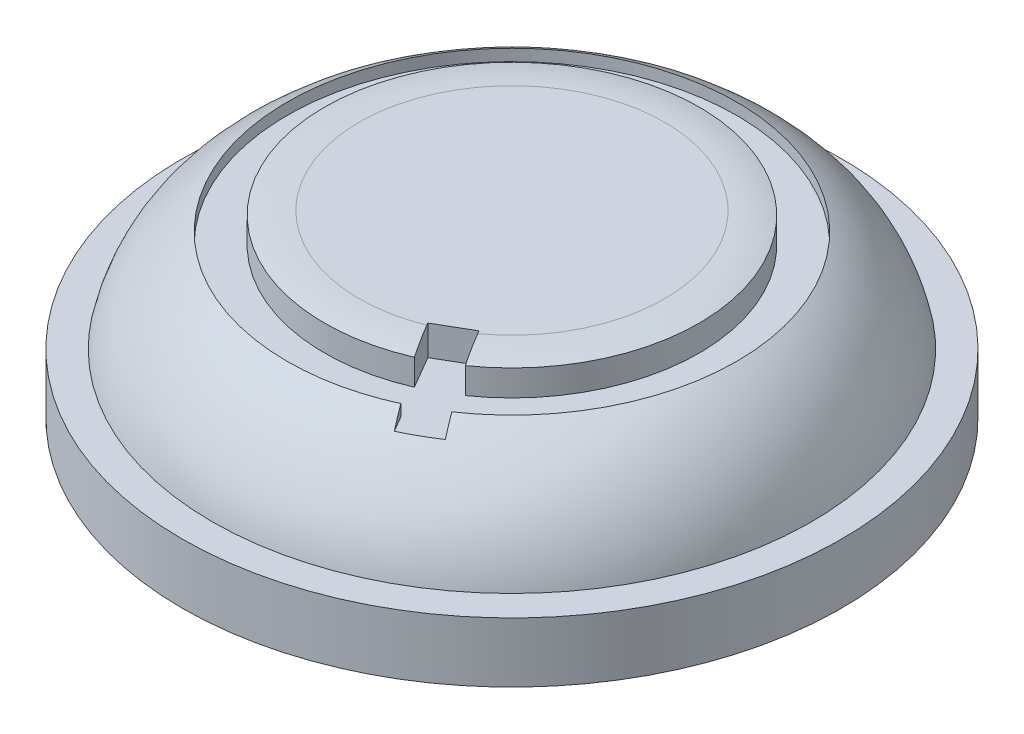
from build123d import *

# Parameters (mm, degrees)
CUT_EXTRUDE1_DEPTH = 1


with BuildPart() as part:
    # Sketch1 → Revolve2 (revolve)
    with BuildSketch(Plane.XY, mode=Mode.PRIVATE) as revolve2_sk:
        with BuildLine():
            Line((0, 0), (-5.101020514, 0))
            ThreePointArc((-5.101020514, 0), (-8.263298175, -1.127016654), (-10, -4))
            Line((-10, -4), (-11, -4))
            Line((-11, -4), (-11, -6))
            Line((-11, -6), (-10, -6))
            Line((-10, -6), (-10, -4.5))
            Line((-10, -4.5), (0, -4.5))
            Line((0, -4.5), (0, 0))
        make_face()
    revolve(revolve2_sk.sketch.rotate(Axis((0, 8.274041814, 0), (0, -1, 0)), 270), axis=Axis((0, 8.274041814, 0), (0, -1, 0)))

    # Sketch2 → Cut-Extrude1 (cut)
    with BuildSketch(Plane(origin=(0, 0, 0), x_dir=(1, 0, 0), z_dir=(0, 1, 0))):
        with BuildLine():
            Line((3.707383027, -7.839822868), (4.786953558, -7.209721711))
            Line((4.786953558, -7.209721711), (4.204024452, -6.21097242))
            ThreePointArc((4.204024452, -6.21097242), (-3.671744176, 6.539747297), (3.113914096, -6.823015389))
            Line((3.113914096, -6.823015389), (3.707383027, -7.839822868))
        make_face()
        with BuildLine():
            Line((1.849896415, -4.657337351), (2.479997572, -5.736907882))
            ThreePointArc((2.479997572, -5.736907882), (-3.041368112, 5.460089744), (3.572236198, -5.128511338))
            Line((3.572236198, -5.128511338), (2.929466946, -4.027236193))
            Line((2.929466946, -4.027236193), (1.849896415, -4.657337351))
        make_face(mode=Mode.SUBTRACT)
    extrude(amount=-CUT_EXTRUDE1_DEPTH, mode=Mode.SUBTRACT)


solid = part.part
